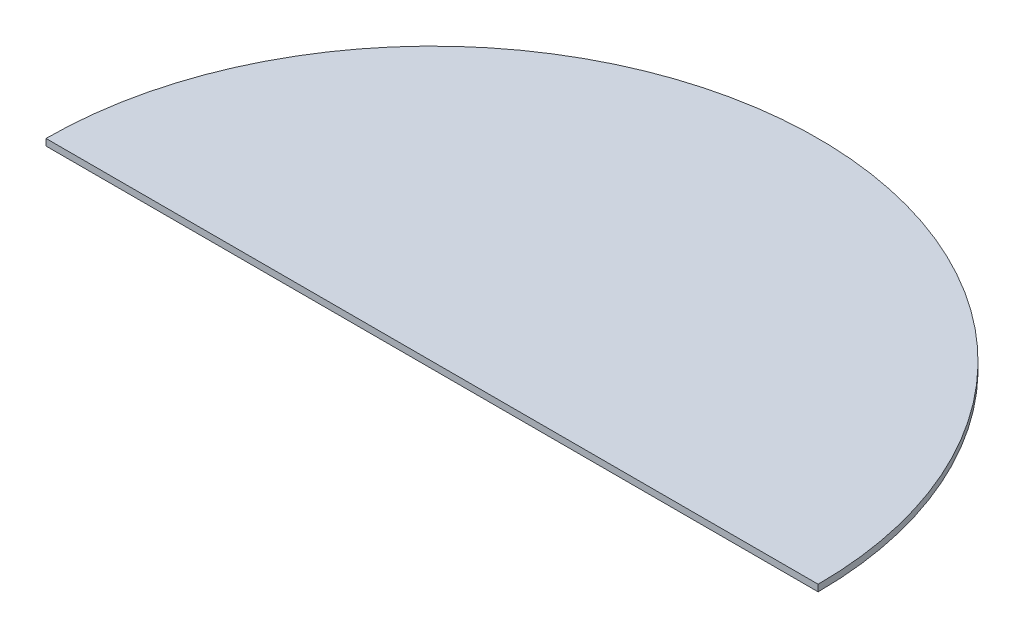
ISO-10303-21;
HEADER;
FILE_DESCRIPTION(('STEP AP214'),'2;1');
FILE_NAME('part.step','',(''),(''),'','','');
FILE_SCHEMA(('AUTOMOTIVE_DESIGN { 1 0 10303 214 1 1 1 1 }'));
ENDSEC;
DATA;
#1=APPLICATION_CONTEXT('core data for automotive mechanical design processes');
#2=APPLICATION_PROTOCOL_DEFINITION('international standard','automotive_design',2000,#1);
#3=PRODUCT_CONTEXT('',#1,'mechanical');
#4=PRODUCT('Part','Part','',(#3));
#5=PRODUCT_RELATED_PRODUCT_CATEGORY('part','',(#4));
#6=PRODUCT_DEFINITION_FORMATION('','',#4);
#7=PRODUCT_DEFINITION_CONTEXT('part definition',#1,'design');
#8=PRODUCT_DEFINITION('design','',#6,#7);
#9=PRODUCT_DEFINITION_SHAPE('','',#8);
#10=(LENGTH_UNIT() NAMED_UNIT(*) SI_UNIT(.MILLI.,.METRE.));
#11=(NAMED_UNIT(*) PLANE_ANGLE_UNIT() SI_UNIT($,.RADIAN.));
#12=(NAMED_UNIT(*) SI_UNIT($,.STERADIAN.) SOLID_ANGLE_UNIT());
#13=UNCERTAINTY_MEASURE_WITH_UNIT(LENGTH_MEASURE(1.E-05),#10,'distance_accuracy_value','');
#14=(GEOMETRIC_REPRESENTATION_CONTEXT(3) GLOBAL_UNCERTAINTY_ASSIGNED_CONTEXT((#13)) GLOBAL_UNIT_ASSIGNED_CONTEXT((#10,
#11,#12)) REPRESENTATION_CONTEXT('',''));
#15=CARTESIAN_POINT('',(0.,0.,0.));
#16=DIRECTION('',(0.,0.,1.));
#17=DIRECTION('',(1.,0.,0.));
#18=AXIS2_PLACEMENT_3D('',#15,#16,#17);
#19=CARTESIAN_POINT('',(70.,1.2,0.));
#20=DIRECTION('',(0.,-1.,0.));
#21=DIRECTION('',(0.,0.,-1.));
#22=AXIS2_PLACEMENT_3D('',#19,#20,#21);
#23=CYLINDRICAL_SURFACE('',#22,70.);
#24=CARTESIAN_POINT('',(70.,0.,0.));
#25=DIRECTION('',(0.,1.,0.));
#26=DIRECTION('',(0.,0.,1.));
#27=AXIS2_PLACEMENT_3D('',#24,#25,#26);
#28=CIRCLE('',#27,70.);
#29=CARTESIAN_POINT('',(140.,0.,0.));
#30=VERTEX_POINT('',#29);
#31=CARTESIAN_POINT('',(0.,0.,0.));
#32=VERTEX_POINT('',#31);
#33=EDGE_CURVE('E60',#30,#32,#28,.T.);
#34=ORIENTED_EDGE('',*,*,#33,.T.);
#35=DIRECTION('',(0.,-1.,0.));
#36=VECTOR('',#35,1.);
#37=CARTESIAN_POINT('',(0.,1.2,0.));
#38=LINE('',#37,#36);
#39=CARTESIAN_POINT('',(0.,1.2,0.));
#40=VERTEX_POINT('',#39);
#41=EDGE_CURVE('E11',#40,#32,#38,.T.);
#42=ORIENTED_EDGE('',*,*,#41,.F.);
#43=CARTESIAN_POINT('',(70.,1.2,0.));
#44=DIRECTION('',(0.,1.,0.));
#45=DIRECTION('',(0.,0.,1.));
#46=AXIS2_PLACEMENT_3D('',#43,#44,#45);
#47=CIRCLE('',#46,70.);
#48=CARTESIAN_POINT('',(140.,1.2,0.));
#49=VERTEX_POINT('',#48);
#50=EDGE_CURVE('E62',#49,#40,#47,.T.);
#51=ORIENTED_EDGE('',*,*,#50,.F.);
#52=DIRECTION('',(0.,-1.,0.));
#53=VECTOR('',#52,1.);
#54=CARTESIAN_POINT('',(140.,1.2,0.));
#55=LINE('',#54,#53);
#56=EDGE_CURVE('E40',#49,#30,#55,.T.);
#57=ORIENTED_EDGE('',*,*,#56,.T.);
#58=EDGE_LOOP('',(#34,#42,#51,#57));
#59=FACE_BOUND('',#58,.T.);
#60=ADVANCED_FACE('F33',(#59),#23,.T.);
#61=CARTESIAN_POINT('',(0.,1.2,0.));
#62=DIRECTION('',(0.,0.,-1.));
#63=DIRECTION('',(-1.,0.,0.));
#64=AXIS2_PLACEMENT_3D('',#61,#62,#63);
#65=PLANE('',#64);
#66=DIRECTION('',(1.,0.,0.));
#67=VECTOR('',#66,1.);
#68=CARTESIAN_POINT('',(0.,0.,0.));
#69=LINE('',#68,#67);
#70=EDGE_CURVE('E57',#32,#30,#69,.T.);
#71=ORIENTED_EDGE('',*,*,#70,.T.);
#72=ORIENTED_EDGE('',*,*,#56,.F.);
#73=DIRECTION('',(1.,0.,0.));
#74=VECTOR('',#73,1.);
#75=CARTESIAN_POINT('',(0.,1.2,0.));
#76=LINE('',#75,#74);
#77=EDGE_CURVE('E46',#40,#49,#76,.T.);
#78=ORIENTED_EDGE('',*,*,#77,.F.);
#79=ORIENTED_EDGE('',*,*,#41,.T.);
#80=EDGE_LOOP('',(#71,#72,#78,#79));
#81=FACE_BOUND('',#80,.T.);
#82=ADVANCED_FACE('F65',(#81),#65,.F.);
#83=CARTESIAN_POINT('',(70.,1.2,0.));
#84=DIRECTION('',(0.,1.,0.));
#85=DIRECTION('',(0.,0.,1.));
#86=AXIS2_PLACEMENT_3D('',#83,#84,#85);
#87=PLANE('',#86);
#88=ORIENTED_EDGE('',*,*,#50,.T.);
#89=ORIENTED_EDGE('',*,*,#77,.T.);
#90=EDGE_LOOP('',(#88,#89));
#91=FACE_BOUND('',#90,.T.);
#92=ADVANCED_FACE('F71',(#91),#87,.T.);
#93=CARTESIAN_POINT('',(70.,0.,0.));
#94=DIRECTION('',(0.,1.,0.));
#95=DIRECTION('',(0.,0.,1.));
#96=AXIS2_PLACEMENT_3D('',#93,#94,#95);
#97=PLANE('',#96);
#98=ORIENTED_EDGE('',*,*,#33,.F.);
#99=ORIENTED_EDGE('',*,*,#70,.F.);
#100=EDGE_LOOP('',(#98,#99));
#101=FACE_BOUND('',#100,.T.);
#102=ADVANCED_FACE('F58',(#101),#97,.F.);
#103=CLOSED_SHELL('',(#60,#82,#92,#102));
#104=MANIFOLD_SOLID_BREP('B2',#103);
#105=ADVANCED_BREP_SHAPE_REPRESENTATION('',(#18,#104),#14);
#106=SHAPE_DEFINITION_REPRESENTATION(#9,#105);
ENDSEC;
END-ISO-10303-21;
